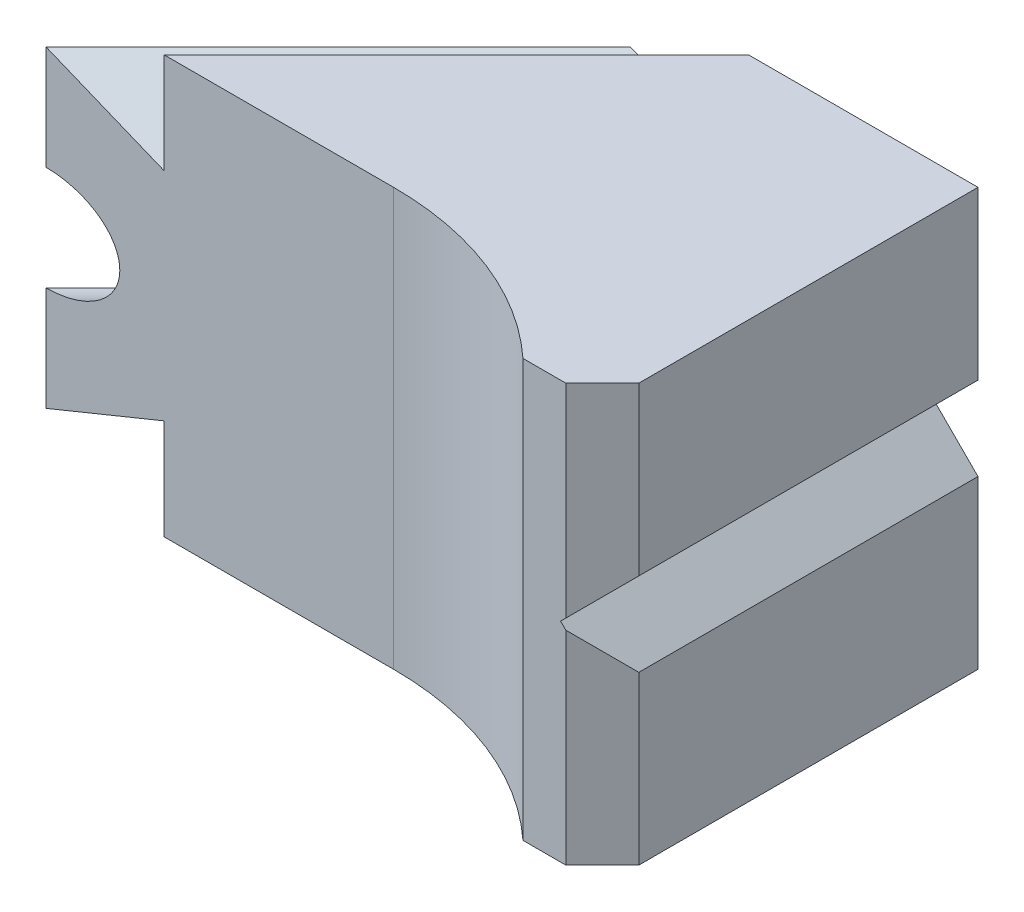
ISO-10303-21;
HEADER;
FILE_DESCRIPTION(('STEP AP214'),'2;1');
FILE_NAME('part.step','',(''),(''),'','','');
FILE_SCHEMA(('AUTOMOTIVE_DESIGN { 1 0 10303 214 1 1 1 1 }'));
ENDSEC;
DATA;
#1=APPLICATION_CONTEXT('core data for automotive mechanical design processes');
#2=APPLICATION_PROTOCOL_DEFINITION('international standard','automotive_design',2000,#1);
#3=PRODUCT_CONTEXT('',#1,'mechanical');
#4=PRODUCT('Part','Part','',(#3));
#5=PRODUCT_RELATED_PRODUCT_CATEGORY('part','',(#4));
#6=PRODUCT_DEFINITION_FORMATION('','',#4);
#7=PRODUCT_DEFINITION_CONTEXT('part definition',#1,'design');
#8=PRODUCT_DEFINITION('design','',#6,#7);
#9=PRODUCT_DEFINITION_SHAPE('','',#8);
#10=(LENGTH_UNIT() NAMED_UNIT(*) SI_UNIT(.MILLI.,.METRE.));
#11=(NAMED_UNIT(*) PLANE_ANGLE_UNIT() SI_UNIT($,.RADIAN.));
#12=(NAMED_UNIT(*) SI_UNIT($,.STERADIAN.) SOLID_ANGLE_UNIT());
#13=UNCERTAINTY_MEASURE_WITH_UNIT(LENGTH_MEASURE(1.E-05),#10,'distance_accuracy_value','');
#14=(GEOMETRIC_REPRESENTATION_CONTEXT(3) GLOBAL_UNCERTAINTY_ASSIGNED_CONTEXT((#13)) GLOBAL_UNIT_ASSIGNED_CONTEXT((#10,
#11,#12)) REPRESENTATION_CONTEXT('',''));
#15=CARTESIAN_POINT('',(0.,0.,0.));
#16=DIRECTION('',(0.,0.,1.));
#17=DIRECTION('',(1.,0.,0.));
#18=AXIS2_PLACEMENT_3D('',#15,#16,#17);
#19=CARTESIAN_POINT('',(-144.75111441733,10.381197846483,156.064822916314));
#20=DIRECTION('',(-0.707106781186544,0.,-0.707106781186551));
#21=DIRECTION('',(0.707106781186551,0.,-0.707106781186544));
#22=AXIS2_PLACEMENT_3D('',#19,#20,#21);
#23=PLANE('',#22);
#24=DIRECTION('',(0.,1.,0.));
#25=VECTOR('',#24,1.);
#26=CARTESIAN_POINT('',(11.3137084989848,20.,0.));
#27=LINE('',#26,#25);
#28=CARTESIAN_POINT('',(11.3137084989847,10.381197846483,0.));
#29=VERTEX_POINT('',#28);
#30=CARTESIAN_POINT('',(11.3137084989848,20.,0.));
#31=VERTEX_POINT('',#30);
#32=EDGE_CURVE('E222',#29,#31,#27,.T.);
#33=ORIENTED_EDGE('',*,*,#32,.F.);
#34=DIRECTION('',(0.707106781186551,0.,-0.707106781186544));
#35=VECTOR('',#34,1.);
#36=CARTESIAN_POINT('',(-144.75111441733,10.381197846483,156.064822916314));
#37=LINE('',#36,#35);
#38=CARTESIAN_POINT('',(-16.6862915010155,10.381197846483,28.));
#39=VERTEX_POINT('',#38);
#40=EDGE_CURVE('E197',#39,#29,#37,.T.);
#41=ORIENTED_EDGE('',*,*,#40,.F.);
#42=DIRECTION('',(0.,-1.,0.));
#43=VECTOR('',#42,1.);
#44=CARTESIAN_POINT('',(-16.6862915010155,20.,28.));
#45=LINE('',#44,#43);
#46=CARTESIAN_POINT('',(-16.6862915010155,20.,28.));
#47=VERTEX_POINT('',#46);
#48=EDGE_CURVE('E219',#47,#39,#45,.T.);
#49=ORIENTED_EDGE('',*,*,#48,.F.);
#50=DIRECTION('',(-0.707106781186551,0.,0.707106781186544));
#51=VECTOR('',#50,1.);
#52=CARTESIAN_POINT('',(-20.6881457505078,20.,32.0018542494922));
#53=LINE('',#52,#51);
#54=EDGE_CURVE('E368',#31,#47,#53,.T.);
#55=ORIENTED_EDGE('',*,*,#54,.F.);
#56=EDGE_LOOP('',(#33,#41,#49,#55));
#57=FACE_BOUND('',#56,.T.);
#58=ADVANCED_FACE('F14',(#57),#23,.T.);
#59=CARTESIAN_POINT('',(-144.75111441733,10.381197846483,156.064822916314));
#60=DIRECTION('',(0.353553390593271,0.86602540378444,0.353553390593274));
#61=DIRECTION('',(0.,0.377964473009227,-0.925820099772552));
#62=AXIS2_PLACEMENT_3D('',#59,#60,#61);
#63=PLANE('',#62);
#64=DIRECTION('',(0.925820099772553,-0.377964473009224,0.));
#65=VECTOR('',#64,1.);
#66=CARTESIAN_POINT('',(-1.7496355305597,15.7142857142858,0.));
#67=LINE('',#66,#65);
#68=CARTESIAN_POINT('',(0.,15.,0.));
#69=VERTEX_POINT('',#68);
#70=EDGE_CURVE('E184',#69,#29,#67,.T.);
#71=ORIENTED_EDGE('',*,*,#70,.F.);
#72=DIRECTION('',(0.707106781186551,0.,-0.707106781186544));
#73=VECTOR('',#72,1.);
#74=CARTESIAN_POINT('',(-150.407968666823,15.,150.407968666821));
#75=LINE('',#74,#73);
#76=CARTESIAN_POINT('',(-28.,15.,28.));
#77=VERTEX_POINT('',#76);
#78=EDGE_CURVE('E195',#77,#69,#75,.T.);
#79=ORIENTED_EDGE('',*,*,#78,.F.);
#80=DIRECTION('',(-0.925820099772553,0.377964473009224,0.));
#81=VECTOR('',#80,1.);
#82=CARTESIAN_POINT('',(-1.198206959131,4.05821380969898,28.));
#83=LINE('',#82,#81);
#84=EDGE_CURVE('E22',#39,#77,#83,.T.);
#85=ORIENTED_EDGE('',*,*,#84,.F.);
#86=ORIENTED_EDGE('',*,*,#40,.T.);
#87=EDGE_LOOP('',(#71,#79,#85,#86));
#88=FACE_BOUND('',#87,.T.);
#89=ADVANCED_FACE('F193',(#88),#63,.T.);
#90=CARTESIAN_POINT('',(-150.407968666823,0.,150.407968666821));
#91=DIRECTION('',(0.707106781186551,0.,-0.707106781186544));
#92=DIRECTION('',(0.707106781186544,0.,0.707106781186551));
#93=AXIS2_PLACEMENT_3D('',#90,#91,#92);
#94=CYLINDRICAL_SURFACE('',#93,8.9);
#95=DIRECTION('',(0.707106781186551,0.,-0.707106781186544));
#96=VECTOR('',#95,1.);
#97=CARTESIAN_POINT('',(-150.40796864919,8.9,150.407968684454));
#98=LINE('',#97,#96);
#99=CARTESIAN_POINT('',(-19.868272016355,8.9,19.8682720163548));
#100=VERTEX_POINT('',#99);
#101=CARTESIAN_POINT('',(-5.726136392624,8.9,5.72613639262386));
#102=VERTEX_POINT('',#101);
#103=EDGE_CURVE('E202',#100,#102,#98,.T.);
#104=ORIENTED_EDGE('',*,*,#103,.T.);
#105=CARTESIAN_POINT('',(-5.726136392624,0.,5.7261363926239));
#106=DIRECTION('',(-0.707106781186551,0.,0.707106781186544));
#107=DIRECTION('',(-0.707106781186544,0.,-0.707106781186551));
#108=AXIS2_PLACEMENT_3D('',#105,#106,#107);
#109=CIRCLE('',#108,8.9);
#110=CARTESIAN_POINT('',(-5.726136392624,-8.9,5.72613639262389));
#111=VERTEX_POINT('',#110);
#112=EDGE_CURVE('E216',#102,#111,#109,.T.);
#113=ORIENTED_EDGE('',*,*,#112,.T.);
#114=DIRECTION('',(0.707106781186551,0.,-0.707106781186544));
#115=VECTOR('',#114,1.);
#116=CARTESIAN_POINT('',(-150.407968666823,-8.9,150.407968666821));
#117=LINE('',#116,#115);
#118=CARTESIAN_POINT('',(-19.868272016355,-8.9,19.8682720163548));
#119=VERTEX_POINT('',#118);
#120=EDGE_CURVE('E205',#119,#111,#117,.T.);
#121=ORIENTED_EDGE('',*,*,#120,.F.);
#122=CARTESIAN_POINT('',(-19.868272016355,0.,19.8682720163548));
#123=DIRECTION('',(-0.707106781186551,0.,0.707106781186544));
#124=DIRECTION('',(-0.707106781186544,0.,-0.707106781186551));
#125=AXIS2_PLACEMENT_3D('',#122,#123,#124);
#126=CIRCLE('',#125,8.9);
#127=EDGE_CURVE('E366',#100,#119,#126,.T.);
#128=ORIENTED_EDGE('',*,*,#127,.F.);
#129=EDGE_LOOP('',(#104,#113,#121,#128));
#130=FACE_BOUND('',#129,.T.);
#131=ADVANCED_FACE('F431',(#130),#94,.T.);
#132=CARTESIAN_POINT('',(-144.75111441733,-10.381197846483,156.064822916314));
#133=DIRECTION('',(-0.707106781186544,0.,-0.707106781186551));
#134=DIRECTION('',(0.707106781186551,0.,-0.707106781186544));
#135=AXIS2_PLACEMENT_3D('',#132,#133,#134);
#136=PLANE('',#135);
#137=DIRECTION('',(0.,1.,0.));
#138=VECTOR('',#137,1.);
#139=CARTESIAN_POINT('',(11.3137084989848,20.,0.));
#140=LINE('',#139,#138);
#141=CARTESIAN_POINT('',(11.3137084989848,-20.,0.));
#142=VERTEX_POINT('',#141);
#143=CARTESIAN_POINT('',(11.3137084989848,-10.381197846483,0.));
#144=VERTEX_POINT('',#143);
#145=EDGE_CURVE('E29',#142,#144,#140,.T.);
#146=ORIENTED_EDGE('',*,*,#145,.F.);
#147=DIRECTION('',(-0.707106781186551,0.,0.707106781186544));
#148=VECTOR('',#147,1.);
#149=CARTESIAN_POINT('',(-20.6881457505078,-20.,32.0018542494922));
#150=LINE('',#149,#148);
#151=CARTESIAN_POINT('',(-16.6862915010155,-20.,28.));
#152=VERTEX_POINT('',#151);
#153=EDGE_CURVE('E371',#142,#152,#150,.T.);
#154=ORIENTED_EDGE('',*,*,#153,.T.);
#155=DIRECTION('',(0.,-1.,0.));
#156=VECTOR('',#155,1.);
#157=CARTESIAN_POINT('',(-16.6862915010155,20.,28.));
#158=LINE('',#157,#156);
#159=CARTESIAN_POINT('',(-16.6862915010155,-10.381197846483,28.));
#160=VERTEX_POINT('',#159);
#161=EDGE_CURVE('E224',#160,#152,#158,.T.);
#162=ORIENTED_EDGE('',*,*,#161,.F.);
#163=DIRECTION('',(0.707106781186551,0.,-0.707106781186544));
#164=VECTOR('',#163,1.);
#165=CARTESIAN_POINT('',(-144.75111441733,-10.381197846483,156.064822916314));
#166=LINE('',#165,#164);
#167=EDGE_CURVE('E213',#160,#144,#166,.T.);
#168=ORIENTED_EDGE('',*,*,#167,.T.);
#169=EDGE_LOOP('',(#146,#154,#162,#168));
#170=FACE_BOUND('',#169,.T.);
#171=ADVANCED_FACE('F414',(#170),#136,.T.);
#172=CARTESIAN_POINT('',(-144.75111441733,-10.381197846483,156.064822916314));
#173=DIRECTION('',(0.353553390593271,-0.86602540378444,0.353553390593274));
#174=DIRECTION('',(0.,0.377964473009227,0.925820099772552));
#175=AXIS2_PLACEMENT_3D('',#172,#173,#174);
#176=PLANE('',#175);
#177=DIRECTION('',(-0.925820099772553,-0.377964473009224,0.));
#178=VECTOR('',#177,1.);
#179=CARTESIAN_POINT('',(12.2474487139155,-10.0000000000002,0.));
#180=LINE('',#179,#178);
#181=CARTESIAN_POINT('',(0.,-15.,0.));
#182=VERTEX_POINT('',#181);
#183=EDGE_CURVE('E185',#144,#182,#180,.T.);
#184=ORIENTED_EDGE('',*,*,#183,.F.);
#185=ORIENTED_EDGE('',*,*,#167,.F.);
#186=DIRECTION('',(0.925820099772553,0.377964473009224,0.));
#187=VECTOR('',#186,1.);
#188=CARTESIAN_POINT('',(12.7988772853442,1.65607190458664,28.));
#189=LINE('',#188,#187);
#190=CARTESIAN_POINT('',(-28.0000000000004,-15.,28.));
#191=VERTEX_POINT('',#190);
#192=EDGE_CURVE('E9',#191,#160,#189,.T.);
#193=ORIENTED_EDGE('',*,*,#192,.F.);
#194=DIRECTION('',(0.707106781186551,0.,-0.707106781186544));
#195=VECTOR('',#194,1.);
#196=CARTESIAN_POINT('',(-150.407968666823,-15.,150.407968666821));
#197=LINE('',#196,#195);
#198=EDGE_CURVE('E211',#191,#182,#197,.T.);
#199=ORIENTED_EDGE('',*,*,#198,.T.);
#200=EDGE_LOOP('',(#184,#185,#193,#199));
#201=FACE_BOUND('',#200,.T.);
#202=ADVANCED_FACE('F418',(#201),#176,.T.);
#203=CARTESIAN_POINT('',(-2.98372437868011E-13,20.,0.));
#204=DIRECTION('',(0.,0.,-1.));
#205=DIRECTION('',(-1.,0.,0.));
#206=AXIS2_PLACEMENT_3D('',#203,#204,#205);
#207=PLANE('',#206);
#208=DIRECTION('',(1.,0.,0.));
#209=VECTOR('',#208,1.);
#210=CARTESIAN_POINT('',(-2.98372437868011E-13,20.,0.));
#211=LINE('',#210,#209);
#212=CARTESIAN_POINT('',(33.31,20.,0.));
#213=VERTEX_POINT('',#212);
#214=EDGE_CURVE('E286',#31,#213,#211,.T.);
#215=ORIENTED_EDGE('',*,*,#214,.T.);
#216=DIRECTION('',(0.,-1.,0.));
#217=VECTOR('',#216,1.);
#218=CARTESIAN_POINT('',(33.31,20.,0.));
#219=LINE('',#218,#217);
#220=CARTESIAN_POINT('',(33.31,4.00000000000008,0.));
#221=VERTEX_POINT('',#220);
#222=EDGE_CURVE('E291',#213,#221,#219,.T.);
#223=ORIENTED_EDGE('',*,*,#222,.T.);
#224=DIRECTION('',(-0.707106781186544,-0.707106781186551,0.));
#225=VECTOR('',#224,1.);
#226=CARTESIAN_POINT('',(33.31,4.00000000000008,0.));
#227=LINE('',#226,#225);
#228=CARTESIAN_POINT('',(29.31,0.,0.));
#229=VERTEX_POINT('',#228);
#230=EDGE_CURVE('E229',#221,#229,#227,.T.);
#231=ORIENTED_EDGE('',*,*,#230,.T.);
#232=DIRECTION('',(-0.707106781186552,0.707106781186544,0.));
#233=VECTOR('',#232,1.);
#234=CARTESIAN_POINT('',(33.31,-4.,0.));
#235=LINE('',#234,#233);
#236=CARTESIAN_POINT('',(33.31,-4.,0.));
#237=VERTEX_POINT('',#236);
#238=EDGE_CURVE('E230',#237,#229,#235,.T.);
#239=ORIENTED_EDGE('',*,*,#238,.F.);
#240=CARTESIAN_POINT('',(33.31,-20.,0.));
#241=VERTEX_POINT('',#240);
#242=EDGE_CURVE('E187',#237,#241,#219,.T.);
#243=ORIENTED_EDGE('',*,*,#242,.T.);
#244=DIRECTION('',(1.,0.,0.));
#245=VECTOR('',#244,1.);
#246=CARTESIAN_POINT('',(-2.98372437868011E-13,-20.,0.));
#247=LINE('',#246,#245);
#248=EDGE_CURVE('E270',#142,#241,#247,.T.);
#249=ORIENTED_EDGE('',*,*,#248,.F.);
#250=ORIENTED_EDGE('',*,*,#145,.T.);
#251=ORIENTED_EDGE('',*,*,#183,.T.);
#252=DIRECTION('',(0.,-1.,0.));
#253=VECTOR('',#252,1.);
#254=CARTESIAN_POINT('',(-2.98372437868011E-13,20.,0.));
#255=LINE('',#254,#253);
#256=EDGE_CURVE('E37',#69,#182,#255,.T.);
#257=ORIENTED_EDGE('',*,*,#256,.F.);
#258=ORIENTED_EDGE('',*,*,#70,.T.);
#259=ORIENTED_EDGE('',*,*,#32,.T.);
#260=EDGE_LOOP('',(#215,#223,#231,#239,#243,#249,#250,#251,#257,#258,#259));
#261=FACE_BOUND('',#260,.T.);
#262=ADVANCED_FACE('F182',(#261),#207,.T.);
#263=CARTESIAN_POINT('',(5.3099999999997,20.,28.));
#264=DIRECTION('',(0.,0.,1.));
#265=DIRECTION('',(1.,0.,0.));
#266=AXIS2_PLACEMENT_3D('',#263,#264,#265);
#267=PLANE('',#266);
#268=ORIENTED_EDGE('',*,*,#192,.T.);
#269=ORIENTED_EDGE('',*,*,#161,.T.);
#270=DIRECTION('',(-1.,0.,0.));
#271=VECTOR('',#270,1.);
#272=CARTESIAN_POINT('',(5.3099999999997,-20.,28.));
#273=LINE('',#272,#271);
#274=CARTESIAN_POINT('',(5.3099999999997,-20.,28.));
#275=VERTEX_POINT('',#274);
#276=EDGE_CURVE('E256',#275,#152,#273,.T.);
#277=ORIENTED_EDGE('',*,*,#276,.F.);
#278=DIRECTION('',(0.,-1.,0.));
#279=VECTOR('',#278,1.);
#280=CARTESIAN_POINT('',(5.3099999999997,20.,28.));
#281=LINE('',#280,#279);
#282=CARTESIAN_POINT('',(5.3099999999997,20.,28.));
#283=VERTEX_POINT('',#282);
#284=EDGE_CURVE('E304',#283,#275,#281,.T.);
#285=ORIENTED_EDGE('',*,*,#284,.F.);
#286=DIRECTION('',(-1.,0.,0.));
#287=VECTOR('',#286,1.);
#288=CARTESIAN_POINT('',(5.3099999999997,20.,28.));
#289=LINE('',#288,#287);
#290=EDGE_CURVE('E260',#283,#47,#289,.T.);
#291=ORIENTED_EDGE('',*,*,#290,.T.);
#292=ORIENTED_EDGE('',*,*,#48,.T.);
#293=ORIENTED_EDGE('',*,*,#84,.T.);
#294=DIRECTION('',(0.,-1.,0.));
#295=VECTOR('',#294,1.);
#296=CARTESIAN_POINT('',(-28.0000000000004,20.,28.));
#297=LINE('',#296,#295);
#298=CARTESIAN_POINT('',(-28.0000000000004,5.,28.));
#299=VERTEX_POINT('',#298);
#300=EDGE_CURVE('E188',#77,#299,#297,.T.);
#301=ORIENTED_EDGE('',*,*,#300,.T.);
#302=CARTESIAN_POINT('',(-28.0000000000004,0.,28.));
#303=DIRECTION('',(0.,0.,1.));
#304=DIRECTION('',(-1.,0.,0.));
#305=AXIS2_PLACEMENT_3D('',#302,#303,#304);
#306=ELLIPSE('',#305,7.07106781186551,5.);
#307=CARTESIAN_POINT('',(-28.0000000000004,-5.,28.));
#308=VERTEX_POINT('',#307);
#309=EDGE_CURVE('E253',#308,#299,#306,.T.);
#310=ORIENTED_EDGE('',*,*,#309,.F.);
#311=EDGE_CURVE('E276',#308,#191,#297,.T.);
#312=ORIENTED_EDGE('',*,*,#311,.T.);
#313=EDGE_LOOP('',(#268,#269,#277,#285,#291,#292,#293,#301,#310,#312));
#314=FACE_BOUND('',#313,.T.);
#315=ADVANCED_FACE('F374',(#314),#267,.T.);
#316=CARTESIAN_POINT('',(5.3099999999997,-20.,58.));
#317=DIRECTION('',(0.,1.,0.));
#318=DIRECTION('',(0.,0.,1.));
#319=AXIS2_PLACEMENT_3D('',#316,#317,#318);
#320=PLANE('',#319);
#321=ORIENTED_EDGE('',*,*,#248,.T.);
#322=DIRECTION('',(0.,0.,-1.));
#323=VECTOR('',#322,1.);
#324=CARTESIAN_POINT('',(33.31,-20.,32.5));
#325=LINE('',#324,#323);
#326=CARTESIAN_POINT('',(33.31,-20.,32.5));
#327=VERTEX_POINT('',#326);
#328=EDGE_CURVE('E267',#327,#241,#325,.T.);
#329=ORIENTED_EDGE('',*,*,#328,.F.);
#330=DIRECTION('',(-0.707106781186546,0.,0.70710678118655));
#331=VECTOR('',#330,1.);
#332=CARTESIAN_POINT('',(33.31,-20.,32.5));
#333=LINE('',#332,#331);
#334=CARTESIAN_POINT('',(29.81,-20.,36.));
#335=VERTEX_POINT('',#334);
#336=EDGE_CURVE('E264',#327,#335,#333,.T.);
#337=ORIENTED_EDGE('',*,*,#336,.T.);
#338=DIRECTION('',(-1.,0.,0.));
#339=VECTOR('',#338,1.);
#340=CARTESIAN_POINT('',(29.81,-20.,36.));
#341=LINE('',#340,#339);
#342=CARTESIAN_POINT('',(25.7060780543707,-20.,36.));
#343=VERTEX_POINT('',#342);
#344=EDGE_CURVE('E261',#335,#343,#341,.T.);
#345=ORIENTED_EDGE('',*,*,#344,.T.);
#346=CARTESIAN_POINT('',(5.3099999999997,-20.,58.));
#347=DIRECTION('',(0.,1.,0.));
#348=DIRECTION('',(0.,0.,1.));
#349=AXIS2_PLACEMENT_3D('',#346,#347,#348);
#350=CIRCLE('',#349,30.);
#351=EDGE_CURVE('E257',#343,#275,#350,.T.);
#352=ORIENTED_EDGE('',*,*,#351,.T.);
#353=ORIENTED_EDGE('',*,*,#276,.T.);
#354=ORIENTED_EDGE('',*,*,#153,.F.);
#355=EDGE_LOOP('',(#321,#329,#337,#345,#352,#353,#354));
#356=FACE_BOUND('',#355,.T.);
#357=ADVANCED_FACE('F407',(#356),#320,.F.);
#358=CARTESIAN_POINT('',(5.3099999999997,20.,58.));
#359=DIRECTION('',(0.,1.,0.));
#360=DIRECTION('',(0.,0.,1.));
#361=AXIS2_PLACEMENT_3D('',#358,#359,#360);
#362=PLANE('',#361);
#363=DIRECTION('',(-1.,0.,0.));
#364=VECTOR('',#363,1.);
#365=CARTESIAN_POINT('',(29.81,20.,36.));
#366=LINE('',#365,#364);
#367=CARTESIAN_POINT('',(29.81,20.,36.));
#368=VERTEX_POINT('',#367);
#369=CARTESIAN_POINT('',(25.7060780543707,20.,36.));
#370=VERTEX_POINT('',#369);
#371=EDGE_CURVE('E277',#368,#370,#366,.T.);
#372=ORIENTED_EDGE('',*,*,#371,.F.);
#373=DIRECTION('',(-0.707106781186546,0.,0.70710678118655));
#374=VECTOR('',#373,1.);
#375=CARTESIAN_POINT('',(33.31,20.,32.5));
#376=LINE('',#375,#374);
#377=CARTESIAN_POINT('',(33.31,20.,32.5));
#378=VERTEX_POINT('',#377);
#379=EDGE_CURVE('E280',#378,#368,#376,.T.);
#380=ORIENTED_EDGE('',*,*,#379,.F.);
#381=DIRECTION('',(0.,0.,-1.));
#382=VECTOR('',#381,1.);
#383=CARTESIAN_POINT('',(33.31,20.,32.5));
#384=LINE('',#383,#382);
#385=EDGE_CURVE('E283',#378,#213,#384,.T.);
#386=ORIENTED_EDGE('',*,*,#385,.T.);
#387=ORIENTED_EDGE('',*,*,#214,.F.);
#388=ORIENTED_EDGE('',*,*,#54,.T.);
#389=ORIENTED_EDGE('',*,*,#290,.F.);
#390=CARTESIAN_POINT('',(5.3099999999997,20.,58.));
#391=DIRECTION('',(0.,1.,0.));
#392=DIRECTION('',(0.,0.,1.));
#393=AXIS2_PLACEMENT_3D('',#390,#391,#392);
#394=CIRCLE('',#393,30.);
#395=EDGE_CURVE('E273',#370,#283,#394,.T.);
#396=ORIENTED_EDGE('',*,*,#395,.F.);
#397=EDGE_LOOP('',(#372,#380,#386,#387,#388,#389,#396));
#398=FACE_BOUND('',#397,.T.);
#399=ADVANCED_FACE('F381',(#398),#362,.T.);
#400=CARTESIAN_POINT('',(-5.726136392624,0.,5.72613639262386));
#401=DIRECTION('',(-0.707106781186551,0.,0.707106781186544));
#402=DIRECTION('',(0.707106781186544,0.,0.707106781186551));
#403=AXIS2_PLACEMENT_3D('',#400,#401,#402);
#404=PLANE('',#403);
#405=ORIENTED_EDGE('',*,*,#112,.F.);
#406=DIRECTION('',(0.,-1.,0.));
#407=VECTOR('',#406,1.);
#408=CARTESIAN_POINT('',(-5.726136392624,20.,5.72613639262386));
#409=LINE('',#408,#407);
#410=EDGE_CURVE('E306',#102,#111,#409,.T.);
#411=ORIENTED_EDGE('',*,*,#410,.T.);
#412=EDGE_LOOP('',(#405,#411));
#413=FACE_BOUND('',#412,.T.);
#414=ADVANCED_FACE('F433',(#413),#404,.F.);
#415=CARTESIAN_POINT('',(-19.868272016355,0.,19.8682720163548));
#416=DIRECTION('',(-0.707106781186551,0.,0.707106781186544));
#417=DIRECTION('',(0.707106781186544,0.,0.707106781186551));
#418=AXIS2_PLACEMENT_3D('',#415,#416,#417);
#419=PLANE('',#418);
#420=DIRECTION('',(0.612372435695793,0.5,0.612372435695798));
#421=VECTOR('',#420,1.);
#422=CARTESIAN_POINT('',(-19.868272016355,-4.618802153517,19.8682720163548));
#423=LINE('',#422,#421);
#424=CARTESIAN_POINT('',(-19.868272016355,-4.618802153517,19.8682720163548));
#425=VERTEX_POINT('',#424);
#426=CARTESIAN_POINT('',(-17.0398448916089,-2.30940107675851,22.6966991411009));
#427=VERTEX_POINT('',#426);
#428=EDGE_CURVE('E318',#425,#427,#423,.T.);
#429=ORIENTED_EDGE('',*,*,#428,.F.);
#430=DIRECTION('',(-0.61237243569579,0.5,-0.612372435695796));
#431=VECTOR('',#430,1.);
#432=CARTESIAN_POINT('',(-19.868272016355,-4.618802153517,19.8682720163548));
#433=LINE('',#432,#431);
#434=CARTESIAN_POINT('',(-22.6966991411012,-2.30940107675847,17.0398448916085));
#435=VERTEX_POINT('',#434);
#436=EDGE_CURVE('E317',#425,#435,#433,.T.);
#437=ORIENTED_EDGE('',*,*,#436,.T.);
#438=DIRECTION('',(0.,-1.,0.));
#439=VECTOR('',#438,1.);
#440=CARTESIAN_POINT('',(-22.6966991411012,2.30940107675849,17.0398448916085));
#441=LINE('',#440,#439);
#442=CARTESIAN_POINT('',(-22.6966991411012,2.30940107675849,17.0398448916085));
#443=VERTEX_POINT('',#442);
#444=EDGE_CURVE('E331',#443,#435,#441,.T.);
#445=ORIENTED_EDGE('',*,*,#444,.F.);
#446=DIRECTION('',(0.61237243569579,0.5,0.612372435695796));
#447=VECTOR('',#446,1.);
#448=CARTESIAN_POINT('',(-22.6966991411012,2.30940107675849,17.0398448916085));
#449=LINE('',#448,#447);
#450=CARTESIAN_POINT('',(-19.8682720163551,4.61880215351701,19.8682720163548));
#451=VERTEX_POINT('',#450);
#452=EDGE_CURVE('E328',#443,#451,#449,.T.);
#453=ORIENTED_EDGE('',*,*,#452,.T.);
#454=DIRECTION('',(-0.612372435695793,0.5,-0.612372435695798));
#455=VECTOR('',#454,1.);
#456=CARTESIAN_POINT('',(-17.0398448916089,2.30940107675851,22.6966991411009));
#457=LINE('',#456,#455);
#458=CARTESIAN_POINT('',(-17.0398448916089,2.30940107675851,22.6966991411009));
#459=VERTEX_POINT('',#458);
#460=EDGE_CURVE('E325',#459,#451,#457,.T.);
#461=ORIENTED_EDGE('',*,*,#460,.F.);
#462=DIRECTION('',(0.,1.,0.));
#463=VECTOR('',#462,1.);
#464=CARTESIAN_POINT('',(-17.0398448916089,-2.30940107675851,22.6966991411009));
#465=LINE('',#464,#463);
#466=EDGE_CURVE('E322',#427,#459,#465,.T.);
#467=ORIENTED_EDGE('',*,*,#466,.F.);
#468=EDGE_LOOP('',(#429,#437,#445,#453,#461,#467));
#469=FACE_BOUND('',#468,.T.);
#470=DIRECTION('',(0.,1.,0.));
#471=VECTOR('',#470,1.);
#472=CARTESIAN_POINT('',(-19.868272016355,20.,19.8682720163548));
#473=LINE('',#472,#471);
#474=CARTESIAN_POINT('',(-19.868272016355,5.,19.8682720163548));
#475=VERTEX_POINT('',#474);
#476=EDGE_CURVE('E308',#475,#100,#473,.T.);
#477=ORIENTED_EDGE('',*,*,#476,.T.);
#478=ORIENTED_EDGE('',*,*,#127,.T.);
#479=CARTESIAN_POINT('',(-19.868272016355,-5.,19.8682720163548));
#480=VERTEX_POINT('',#479);
#481=EDGE_CURVE('E310',#119,#480,#473,.T.);
#482=ORIENTED_EDGE('',*,*,#481,.T.);
#483=CARTESIAN_POINT('',(-19.868272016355,0.,19.8682720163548));
#484=DIRECTION('',(-0.707106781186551,0.,0.707106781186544));
#485=DIRECTION('',(0.707106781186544,0.,0.707106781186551));
#486=AXIS2_PLACEMENT_3D('',#483,#484,#485);
#487=CIRCLE('',#486,5.);
#488=EDGE_CURVE('E250',#480,#475,#487,.T.);
#489=ORIENTED_EDGE('',*,*,#488,.T.);
#490=EDGE_LOOP('',(#477,#478,#482,#489));
#491=FACE_BOUND('',#490,.T.);
#492=ADVANCED_FACE('F16',(#469,#491),#419,.T.);
#493=CARTESIAN_POINT('',(-28.0000000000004,20.,28.));
#494=DIRECTION('',(-0.707106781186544,0.,-0.707106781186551));
#495=DIRECTION('',(-0.707106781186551,0.,0.707106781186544));
#496=AXIS2_PLACEMENT_3D('',#493,#494,#495);
#497=PLANE('',#496);
#498=ORIENTED_EDGE('',*,*,#481,.F.);
#499=ORIENTED_EDGE('',*,*,#120,.T.);
#500=ORIENTED_EDGE('',*,*,#410,.F.);
#501=ORIENTED_EDGE('',*,*,#103,.F.);
#502=ORIENTED_EDGE('',*,*,#476,.F.);
#503=DIRECTION('',(-0.707106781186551,0.,0.707106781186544));
#504=VECTOR('',#503,1.);
#505=CARTESIAN_POINT('',(-28.1421356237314,5.,28.142135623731));
#506=LINE('',#505,#504);
#507=EDGE_CURVE('E311',#299,#475,#506,.F.);
#508=ORIENTED_EDGE('',*,*,#507,.F.);
#509=ORIENTED_EDGE('',*,*,#300,.F.);
#510=ORIENTED_EDGE('',*,*,#78,.T.);
#511=ORIENTED_EDGE('',*,*,#256,.T.);
#512=ORIENTED_EDGE('',*,*,#198,.F.);
#513=ORIENTED_EDGE('',*,*,#311,.F.);
#514=DIRECTION('',(-0.707106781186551,0.,0.707106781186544));
#515=VECTOR('',#514,1.);
#516=CARTESIAN_POINT('',(-28.1421356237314,-5.,28.142135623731));
#517=LINE('',#516,#515);
#518=EDGE_CURVE('E313',#480,#308,#517,.T.);
#519=ORIENTED_EDGE('',*,*,#518,.F.);
#520=EDGE_LOOP('',(#498,#499,#500,#501,#502,#508,#509,#510,#511,#512,#513,#519));
#521=FACE_BOUND('',#520,.T.);
#522=ADVANCED_FACE('F200',(#521),#497,.T.);
#523=CARTESIAN_POINT('',(29.81,20.,36.));
#524=DIRECTION('',(0.,0.,1.));
#525=DIRECTION('',(1.,0.,0.));
#526=AXIS2_PLACEMENT_3D('',#523,#524,#525);
#527=PLANE('',#526);
#528=DIRECTION('',(-0.707106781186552,0.707106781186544,0.));
#529=VECTOR('',#528,1.);
#530=CARTESIAN_POINT('',(33.31,-4.,36.));
#531=LINE('',#530,#529);
#532=CARTESIAN_POINT('',(29.81,-0.500000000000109,36.));
#533=VERTEX_POINT('',#532);
#534=CARTESIAN_POINT('',(29.31,0.,36.));
#535=VERTEX_POINT('',#534);
#536=EDGE_CURVE('E235',#533,#535,#531,.T.);
#537=ORIENTED_EDGE('',*,*,#536,.T.);
#538=DIRECTION('',(-0.707106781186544,-0.707106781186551,0.));
#539=VECTOR('',#538,1.);
#540=CARTESIAN_POINT('',(33.31,4.00000000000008,36.));
#541=LINE('',#540,#539);
#542=CARTESIAN_POINT('',(29.81,0.500000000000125,36.));
#543=VERTEX_POINT('',#542);
#544=EDGE_CURVE('E233',#543,#535,#541,.T.);
#545=ORIENTED_EDGE('',*,*,#544,.F.);
#546=DIRECTION('',(0.,-1.,0.));
#547=VECTOR('',#546,1.);
#548=CARTESIAN_POINT('',(29.81,20.,36.));
#549=LINE('',#548,#547);
#550=EDGE_CURVE('E299',#368,#543,#549,.T.);
#551=ORIENTED_EDGE('',*,*,#550,.F.);
#552=ORIENTED_EDGE('',*,*,#371,.T.);
#553=DIRECTION('',(0.,-1.,0.));
#554=VECTOR('',#553,1.);
#555=CARTESIAN_POINT('',(25.7060780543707,20.,36.));
#556=LINE('',#555,#554);
#557=EDGE_CURVE('E302',#370,#343,#556,.T.);
#558=ORIENTED_EDGE('',*,*,#557,.T.);
#559=ORIENTED_EDGE('',*,*,#344,.F.);
#560=EDGE_CURVE('E298',#533,#335,#549,.T.);
#561=ORIENTED_EDGE('',*,*,#560,.F.);
#562=EDGE_LOOP('',(#537,#545,#551,#552,#558,#559,#561));
#563=FACE_BOUND('',#562,.T.);
#564=ADVANCED_FACE('F399',(#563),#527,.T.);
#565=CARTESIAN_POINT('',(33.31,20.,32.5));
#566=DIRECTION('',(0.70710678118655,0.,0.707106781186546));
#567=DIRECTION('',(0.707106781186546,0.,-0.70710678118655));
#568=AXIS2_PLACEMENT_3D('',#565,#566,#567);
#569=PLANE('',#568);
#570=ORIENTED_EDGE('',*,*,#550,.T.);
#571=DIRECTION('',(0.577350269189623,0.577350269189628,-0.577350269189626));
#572=VECTOR('',#571,1.);
#573=CARTESIAN_POINT('',(38.6433333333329,9.33333333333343,27.1666666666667));
#574=LINE('',#573,#572);
#575=CARTESIAN_POINT('',(33.31,4.00000000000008,32.5));
#576=VERTEX_POINT('',#575);
#577=EDGE_CURVE('E247',#543,#576,#574,.T.);
#578=ORIENTED_EDGE('',*,*,#577,.T.);
#579=DIRECTION('',(0.,-1.,0.));
#580=VECTOR('',#579,1.);
#581=CARTESIAN_POINT('',(33.31,20.,32.5));
#582=LINE('',#581,#580);
#583=EDGE_CURVE('E295',#378,#576,#582,.T.);
#584=ORIENTED_EDGE('',*,*,#583,.F.);
#585=ORIENTED_EDGE('',*,*,#379,.T.);
#586=EDGE_LOOP('',(#570,#578,#584,#585));
#587=FACE_BOUND('',#586,.T.);
#588=ADVANCED_FACE('F478',(#587),#569,.T.);
#589=CARTESIAN_POINT('',(33.31,20.,32.5));
#590=DIRECTION('',(-1.,0.,0.));
#591=DIRECTION('',(0.,0.,1.));
#592=AXIS2_PLACEMENT_3D('',#589,#590,#591);
#593=PLANE('',#592);
#594=DIRECTION('',(0.,0.,-1.));
#595=VECTOR('',#594,1.);
#596=CARTESIAN_POINT('',(33.31,4.00000000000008,36.));
#597=LINE('',#596,#595);
#598=EDGE_CURVE('E242',#576,#221,#597,.T.);
#599=ORIENTED_EDGE('',*,*,#598,.T.);
#600=ORIENTED_EDGE('',*,*,#222,.F.);
#601=ORIENTED_EDGE('',*,*,#385,.F.);
#602=ORIENTED_EDGE('',*,*,#583,.T.);
#603=EDGE_LOOP('',(#599,#600,#601,#602));
#604=FACE_BOUND('',#603,.T.);
#605=ADVANCED_FACE('F389',(#604),#593,.F.);
#606=CARTESIAN_POINT('',(5.3099999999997,20.,58.));
#607=DIRECTION('',(0.,-1.,0.));
#608=DIRECTION('',(0.,0.,-1.));
#609=AXIS2_PLACEMENT_3D('',#606,#607,#608);
#610=CYLINDRICAL_SURFACE('',#609,30.);
#611=ORIENTED_EDGE('',*,*,#557,.F.);
#612=ORIENTED_EDGE('',*,*,#395,.T.);
#613=ORIENTED_EDGE('',*,*,#284,.T.);
#614=ORIENTED_EDGE('',*,*,#351,.F.);
#615=EDGE_LOOP('',(#611,#612,#613,#614));
#616=FACE_BOUND('',#615,.T.);
#617=ADVANCED_FACE('F477',(#616),#610,.F.);
#618=DIRECTION('',(0.577350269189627,-0.57735026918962,-0.57735026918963));
#619=VECTOR('',#618,1.);
#620=CARTESIAN_POINT('',(25.31,3.99999999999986,40.5));
#621=LINE('',#620,#619);
#622=CARTESIAN_POINT('',(33.31,-4.,32.5));
#623=VERTEX_POINT('',#622);
#624=EDGE_CURVE('E244',#533,#623,#621,.T.);
#625=ORIENTED_EDGE('',*,*,#624,.F.);
#626=ORIENTED_EDGE('',*,*,#560,.T.);
#627=ORIENTED_EDGE('',*,*,#336,.F.);
#628=EDGE_CURVE('E294',#623,#327,#582,.T.);
#629=ORIENTED_EDGE('',*,*,#628,.F.);
#630=EDGE_LOOP('',(#625,#626,#627,#629));
#631=FACE_BOUND('',#630,.T.);
#632=ADVANCED_FACE('F403',(#631),#569,.T.);
#633=ORIENTED_EDGE('',*,*,#328,.T.);
#634=ORIENTED_EDGE('',*,*,#242,.F.);
#635=DIRECTION('',(0.,0.,1.));
#636=VECTOR('',#635,1.);
#637=CARTESIAN_POINT('',(33.31,-4.,1.));
#638=LINE('',#637,#636);
#639=EDGE_CURVE('E315',#237,#623,#638,.T.);
#640=ORIENTED_EDGE('',*,*,#639,.T.);
#641=ORIENTED_EDGE('',*,*,#628,.T.);
#642=EDGE_LOOP('',(#633,#634,#640,#641));
#643=FACE_BOUND('',#642,.T.);
#644=ADVANCED_FACE('F412',(#643),#593,.F.);
#645=CARTESIAN_POINT('',(-28.1421356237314,0.,28.142135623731));
#646=DIRECTION('',(-0.707106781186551,0.,0.707106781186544));
#647=DIRECTION('',(0.707106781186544,0.,0.707106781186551));
#648=AXIS2_PLACEMENT_3D('',#645,#646,#647);
#649=CYLINDRICAL_SURFACE('',#648,5.);
#650=ORIENTED_EDGE('',*,*,#518,.T.);
#651=ORIENTED_EDGE('',*,*,#309,.T.);
#652=ORIENTED_EDGE('',*,*,#507,.T.);
#653=ORIENTED_EDGE('',*,*,#488,.F.);
#654=EDGE_LOOP('',(#650,#651,#652,#653));
#655=FACE_BOUND('',#654,.T.);
#656=ADVANCED_FACE('F422',(#655),#649,.F.);
#657=CARTESIAN_POINT('',(33.31,4.00000000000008,36.));
#658=DIRECTION('',(0.707106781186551,-0.707106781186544,0.));
#659=DIRECTION('',(0.707106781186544,0.707106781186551,0.));
#660=AXIS2_PLACEMENT_3D('',#657,#658,#659);
#661=PLANE('',#660);
#662=ORIENTED_EDGE('',*,*,#230,.F.);
#663=ORIENTED_EDGE('',*,*,#598,.F.);
#664=ORIENTED_EDGE('',*,*,#577,.F.);
#665=ORIENTED_EDGE('',*,*,#544,.T.);
#666=DIRECTION('',(0.,0.,-1.));
#667=VECTOR('',#666,1.);
#668=CARTESIAN_POINT('',(29.31,0.,36.));
#669=LINE('',#668,#667);
#670=EDGE_CURVE('E238',#535,#229,#669,.T.);
#671=ORIENTED_EDGE('',*,*,#670,.T.);
#672=EDGE_LOOP('',(#662,#663,#664,#665,#671));
#673=FACE_BOUND('',#672,.T.);
#674=ADVANCED_FACE('F391',(#673),#661,.T.);
#675=CARTESIAN_POINT('',(33.31,-4.,36.));
#676=DIRECTION('',(-0.707106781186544,-0.707106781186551,0.));
#677=DIRECTION('',(0.707106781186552,-0.707106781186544,0.));
#678=AXIS2_PLACEMENT_3D('',#675,#676,#677);
#679=PLANE('',#678);
#680=ORIENTED_EDGE('',*,*,#624,.T.);
#681=ORIENTED_EDGE('',*,*,#639,.F.);
#682=ORIENTED_EDGE('',*,*,#238,.T.);
#683=ORIENTED_EDGE('',*,*,#670,.F.);
#684=ORIENTED_EDGE('',*,*,#536,.F.);
#685=EDGE_LOOP('',(#680,#681,#682,#683,#684));
#686=FACE_BOUND('',#685,.T.);
#687=ADVANCED_FACE('F395',(#686),#679,.F.);
#688=CARTESIAN_POINT('',(-14.2114177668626,-4.618802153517,14.2114177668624));
#689=DIRECTION('',(0.353553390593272,0.866025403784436,0.353553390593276));
#690=DIRECTION('',(-0.61237243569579,0.5,-0.612372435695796));
#691=AXIS2_PLACEMENT_3D('',#688,#689,#690);
#692=PLANE('',#691);
#693=DIRECTION('',(-0.707106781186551,0.,0.707106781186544));
#694=VECTOR('',#693,1.);
#695=CARTESIAN_POINT('',(-17.0398448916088,-2.30940107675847,11.3829906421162));
#696=LINE('',#695,#694);
#697=CARTESIAN_POINT('',(-17.0398448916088,-2.30940107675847,11.3829906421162));
#698=VERTEX_POINT('',#697);
#699=EDGE_CURVE('E364',#698,#435,#696,.T.);
#700=ORIENTED_EDGE('',*,*,#699,.T.);
#701=ORIENTED_EDGE('',*,*,#436,.F.);
#702=DIRECTION('',(-0.707106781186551,0.,0.707106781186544));
#703=VECTOR('',#702,1.);
#704=CARTESIAN_POINT('',(-14.2114177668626,-4.618802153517,14.2114177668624));
#705=LINE('',#704,#703);
#706=CARTESIAN_POINT('',(-14.2114177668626,-4.618802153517,14.2114177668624));
#707=VERTEX_POINT('',#706);
#708=EDGE_CURVE('E339',#707,#425,#705,.T.);
#709=ORIENTED_EDGE('',*,*,#708,.F.);
#710=DIRECTION('',(-0.61237243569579,0.5,-0.612372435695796));
#711=VECTOR('',#710,1.);
#712=CARTESIAN_POINT('',(-14.2114177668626,-4.618802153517,14.2114177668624));
#713=LINE('',#712,#711);
#714=EDGE_CURVE('E321',#707,#698,#713,.T.);
#715=ORIENTED_EDGE('',*,*,#714,.T.);
#716=EDGE_LOOP('',(#700,#701,#709,#715));
#717=FACE_BOUND('',#716,.T.);
#718=ADVANCED_FACE('F460',(#717),#692,.T.);
#719=CARTESIAN_POINT('',(-17.0398448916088,2.30940107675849,11.3829906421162));
#720=DIRECTION('',(-0.707106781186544,0.,-0.707106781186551));
#721=DIRECTION('',(0.,-1.,0.));
#722=AXIS2_PLACEMENT_3D('',#719,#720,#721);
#723=PLANE('',#722);
#724=DIRECTION('',(-0.707106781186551,0.,0.707106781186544));
#725=VECTOR('',#724,1.);
#726=CARTESIAN_POINT('',(-17.0398448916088,2.30940107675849,11.3829906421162));
#727=LINE('',#726,#725);
#728=CARTESIAN_POINT('',(-17.0398448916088,2.30940107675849,11.3829906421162));
#729=VERTEX_POINT('',#728);
#730=EDGE_CURVE('E362',#729,#443,#727,.T.);
#731=ORIENTED_EDGE('',*,*,#730,.T.);
#732=ORIENTED_EDGE('',*,*,#444,.T.);
#733=ORIENTED_EDGE('',*,*,#699,.F.);
#734=DIRECTION('',(0.,-1.,0.));
#735=VECTOR('',#734,1.);
#736=CARTESIAN_POINT('',(-17.0398448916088,2.30940107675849,11.3829906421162));
#737=LINE('',#736,#735);
#738=EDGE_CURVE('E349',#729,#698,#737,.T.);
#739=ORIENTED_EDGE('',*,*,#738,.F.);
#740=EDGE_LOOP('',(#731,#732,#733,#739));
#741=FACE_BOUND('',#740,.T.);
#742=ADVANCED_FACE('F492',(#741),#723,.F.);
#743=CARTESIAN_POINT('',(-17.0398448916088,2.30940107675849,11.3829906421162));
#744=DIRECTION('',(0.353553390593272,-0.866025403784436,0.353553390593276));
#745=DIRECTION('',(0.612372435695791,0.5,0.612372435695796));
#746=AXIS2_PLACEMENT_3D('',#743,#744,#745);
#747=PLANE('',#746);
#748=DIRECTION('',(-0.707106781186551,0.,0.707106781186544));
#749=VECTOR('',#748,1.);
#750=CARTESIAN_POINT('',(-14.2114177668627,4.61880215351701,14.2114177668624));
#751=LINE('',#750,#749);
#752=CARTESIAN_POINT('',(-14.2114177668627,4.61880215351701,14.2114177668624));
#753=VERTEX_POINT('',#752);
#754=EDGE_CURVE('E360',#753,#451,#751,.T.);
#755=ORIENTED_EDGE('',*,*,#754,.T.);
#756=ORIENTED_EDGE('',*,*,#452,.F.);
#757=ORIENTED_EDGE('',*,*,#730,.F.);
#758=DIRECTION('',(0.61237243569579,0.5,0.612372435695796));
#759=VECTOR('',#758,1.);
#760=CARTESIAN_POINT('',(-17.0398448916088,2.30940107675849,11.3829906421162));
#761=LINE('',#760,#759);
#762=EDGE_CURVE('E346',#729,#753,#761,.T.);
#763=ORIENTED_EDGE('',*,*,#762,.T.);
#764=EDGE_LOOP('',(#755,#756,#757,#763));
#765=FACE_BOUND('',#764,.T.);
#766=ADVANCED_FACE('F503',(#765),#747,.T.);
#767=CARTESIAN_POINT('',(-11.3829906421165,2.30940107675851,17.0398448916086));
#768=DIRECTION('',(0.353553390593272,0.86602540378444,0.353553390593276));
#769=DIRECTION('',(-0.612372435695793,0.5,-0.612372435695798));
#770=AXIS2_PLACEMENT_3D('',#767,#768,#769);
#771=PLANE('',#770);
#772=DIRECTION('',(-0.707106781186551,0.,0.707106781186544));
#773=VECTOR('',#772,1.);
#774=CARTESIAN_POINT('',(-11.3829906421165,2.30940107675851,17.0398448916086));
#775=LINE('',#774,#773);
#776=CARTESIAN_POINT('',(-11.3829906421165,2.30940107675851,17.0398448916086));
#777=VERTEX_POINT('',#776);
#778=EDGE_CURVE('E358',#777,#459,#775,.T.);
#779=ORIENTED_EDGE('',*,*,#778,.T.);
#780=ORIENTED_EDGE('',*,*,#460,.T.);
#781=ORIENTED_EDGE('',*,*,#754,.F.);
#782=DIRECTION('',(-0.612372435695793,0.5,-0.612372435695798));
#783=VECTOR('',#782,1.);
#784=CARTESIAN_POINT('',(-11.3829906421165,2.30940107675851,17.0398448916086));
#785=LINE('',#784,#783);
#786=EDGE_CURVE('E343',#777,#753,#785,.T.);
#787=ORIENTED_EDGE('',*,*,#786,.F.);
#788=EDGE_LOOP('',(#779,#780,#781,#787));
#789=FACE_BOUND('',#788,.T.);
#790=ADVANCED_FACE('F499',(#789),#771,.F.);
#791=CARTESIAN_POINT('',(-11.3829906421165,-2.30940107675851,17.0398448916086));
#792=DIRECTION('',(0.707106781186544,0.,0.707106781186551));
#793=DIRECTION('',(0.707106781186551,0.,-0.707106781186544));
#794=AXIS2_PLACEMENT_3D('',#791,#792,#793);
#795=PLANE('',#794);
#796=DIRECTION('',(-0.707106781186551,0.,0.707106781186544));
#797=VECTOR('',#796,1.);
#798=CARTESIAN_POINT('',(-11.3829906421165,-2.30940107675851,17.0398448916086));
#799=LINE('',#798,#797);
#800=CARTESIAN_POINT('',(-11.3829906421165,-2.30940107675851,17.0398448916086));
#801=VERTEX_POINT('',#800);
#802=EDGE_CURVE('E356',#801,#427,#799,.T.);
#803=ORIENTED_EDGE('',*,*,#802,.T.);
#804=ORIENTED_EDGE('',*,*,#466,.T.);
#805=ORIENTED_EDGE('',*,*,#778,.F.);
#806=DIRECTION('',(0.,1.,0.));
#807=VECTOR('',#806,1.);
#808=CARTESIAN_POINT('',(-11.3829906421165,-2.30940107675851,17.0398448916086));
#809=LINE('',#808,#807);
#810=EDGE_CURVE('E340',#801,#777,#809,.T.);
#811=ORIENTED_EDGE('',*,*,#810,.F.);
#812=EDGE_LOOP('',(#803,#804,#805,#811));
#813=FACE_BOUND('',#812,.T.);
#814=ADVANCED_FACE('F489',(#813),#795,.F.);
#815=CARTESIAN_POINT('',(-14.2114177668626,-4.618802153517,14.2114177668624));
#816=DIRECTION('',(0.353553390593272,-0.86602540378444,0.353553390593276));
#817=DIRECTION('',(0.612372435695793,0.5,0.612372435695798));
#818=AXIS2_PLACEMENT_3D('',#815,#816,#817);
#819=PLANE('',#818);
#820=DIRECTION('',(0.612372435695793,0.5,0.612372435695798));
#821=VECTOR('',#820,1.);
#822=CARTESIAN_POINT('',(-14.2114177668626,-4.618802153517,14.2114177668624));
#823=LINE('',#822,#821);
#824=EDGE_CURVE('E336',#707,#801,#823,.T.);
#825=ORIENTED_EDGE('',*,*,#824,.F.);
#826=ORIENTED_EDGE('',*,*,#708,.T.);
#827=ORIENTED_EDGE('',*,*,#428,.T.);
#828=ORIENTED_EDGE('',*,*,#802,.F.);
#829=EDGE_LOOP('',(#825,#826,#827,#828));
#830=FACE_BOUND('',#829,.T.);
#831=ADVANCED_FACE('F487',(#830),#819,.F.);
#832=CARTESIAN_POINT('',(-19.868272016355,0.,8.55456351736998));
#833=DIRECTION('',(0.707106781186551,0.,-0.707106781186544));
#834=DIRECTION('',(-0.707106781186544,0.,-0.707106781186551));
#835=AXIS2_PLACEMENT_3D('',#832,#833,#834);
#836=PLANE('',#835);
#837=ORIENTED_EDGE('',*,*,#714,.F.);
#838=ORIENTED_EDGE('',*,*,#824,.T.);
#839=ORIENTED_EDGE('',*,*,#810,.T.);
#840=ORIENTED_EDGE('',*,*,#786,.T.);
#841=ORIENTED_EDGE('',*,*,#762,.F.);
#842=ORIENTED_EDGE('',*,*,#738,.T.);
#843=EDGE_LOOP('',(#837,#838,#839,#840,#841,#842));
#844=FACE_BOUND('',#843,.T.);
#845=ADVANCED_FACE('F484',(#844),#836,.F.);
#846=CLOSED_SHELL('',(#58,#89,#131,#171,#202,#262,#315,#357,#399,#414,#492,#522,#564,#588,#605,
#617,#632,#644,#656,#674,#687,#718,#742,#766,#790,#814,#831,#845));
#847=MANIFOLD_SOLID_BREP('B1',#846);
#848=ADVANCED_BREP_SHAPE_REPRESENTATION('',(#18,#847),#14);
#849=SHAPE_DEFINITION_REPRESENTATION(#9,#848);
ENDSEC;
END-ISO-10303-21;
